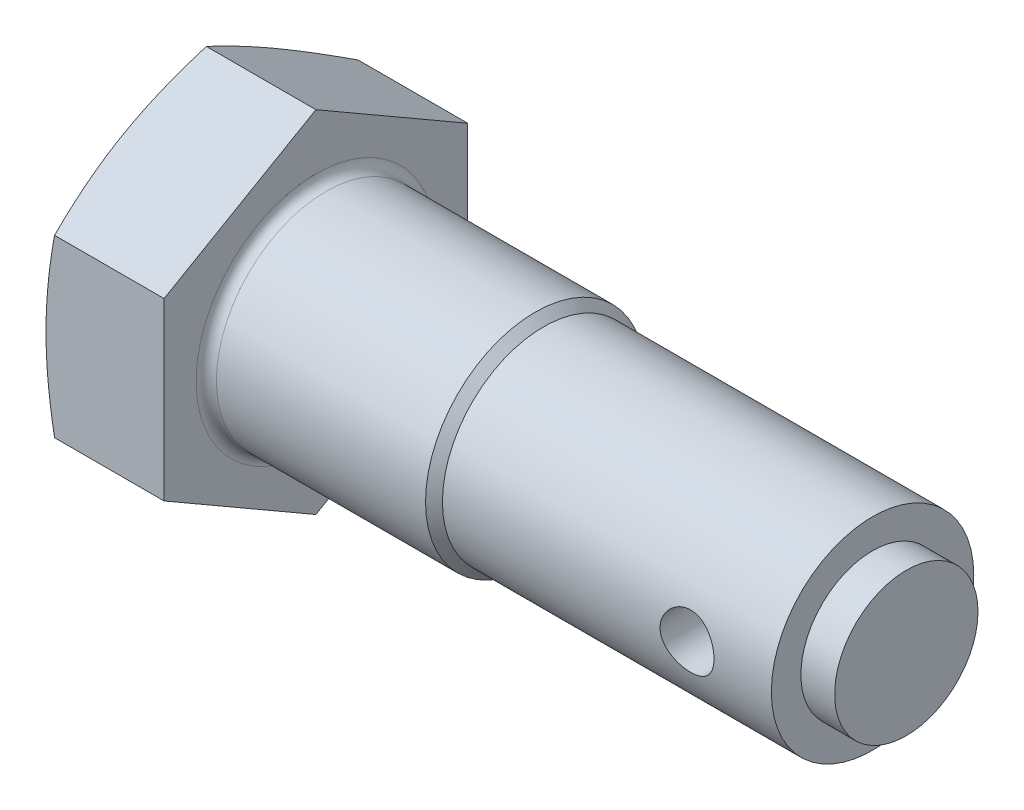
ISO-10303-21;
HEADER;
FILE_DESCRIPTION(('STEP AP214'),'2;1');
FILE_NAME('part.step','',(''),(''),'','','');
FILE_SCHEMA(('AUTOMOTIVE_DESIGN { 1 0 10303 214 1 1 1 1 }'));
ENDSEC;
DATA;
#1=APPLICATION_CONTEXT('core data for automotive mechanical design processes');
#2=APPLICATION_PROTOCOL_DEFINITION('international standard','automotive_design',2000,#1);
#3=PRODUCT_CONTEXT('',#1,'mechanical');
#4=PRODUCT('Part','Part','',(#3));
#5=PRODUCT_RELATED_PRODUCT_CATEGORY('part','',(#4));
#6=PRODUCT_DEFINITION_FORMATION('','',#4);
#7=PRODUCT_DEFINITION_CONTEXT('part definition',#1,'design');
#8=PRODUCT_DEFINITION('design','',#6,#7);
#9=PRODUCT_DEFINITION_SHAPE('','',#8);
#10=(LENGTH_UNIT() NAMED_UNIT(*) SI_UNIT(.MILLI.,.METRE.));
#11=(NAMED_UNIT(*) PLANE_ANGLE_UNIT() SI_UNIT($,.RADIAN.));
#12=(NAMED_UNIT(*) SI_UNIT($,.STERADIAN.) SOLID_ANGLE_UNIT());
#13=UNCERTAINTY_MEASURE_WITH_UNIT(LENGTH_MEASURE(1.E-05),#10,'distance_accuracy_value','');
#14=(GEOMETRIC_REPRESENTATION_CONTEXT(3) GLOBAL_UNCERTAINTY_ASSIGNED_CONTEXT((#13)) GLOBAL_UNIT_ASSIGNED_CONTEXT((#10,
#11,#12)) REPRESENTATION_CONTEXT('',''));
#15=CARTESIAN_POINT('',(0.,0.,0.));
#16=DIRECTION('',(0.,0.,1.));
#17=DIRECTION('',(1.,0.,0.));
#18=AXIS2_PLACEMENT_3D('',#15,#16,#17);
#19=CARTESIAN_POINT('',(7.,-5.19615242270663,9.));
#20=DIRECTION('',(0.,0.866025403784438,-0.5));
#21=DIRECTION('',(0.,0.5,0.866025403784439));
#22=AXIS2_PLACEMENT_3D('',#19,#20,#21);
#23=PLANE('',#22);
#24=CARTESIAN_POINT('',(0.506799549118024,-10.3924203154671,-0.000199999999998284));
#25=CARTESIAN_POINT('',(0.428447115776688,-10.1772266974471,0.372526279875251));
#26=CARTESIAN_POINT('',(0.357172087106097,-9.96132347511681,0.746481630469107));
#27=CARTESIAN_POINT('',(0.231774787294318,-9.52811323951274,1.49682376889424));
#28=CARTESIAN_POINT('',(0.177665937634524,-9.31080526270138,1.87321222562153));
#29=CARTESIAN_POINT('',(0.0901464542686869,-8.87719707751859,2.62424363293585));
#30=CARTESIAN_POINT('',(0.0565449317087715,-8.66090677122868,2.9988694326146));
#31=CARTESIAN_POINT('',(0.0114758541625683,-8.22782037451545,3.74899707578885));
#32=CARTESIAN_POINT('',(0.,-8.0110245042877,4.12449853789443));
#33=CARTESIAN_POINT('',(0.,-7.57743276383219,4.87550146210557));
#34=CARTESIAN_POINT('',(0.0114758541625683,-7.36063689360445,5.25100292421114));
#35=CARTESIAN_POINT('',(0.0565449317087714,-6.92755049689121,6.00113056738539));
#36=CARTESIAN_POINT('',(0.0901464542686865,-6.71126019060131,6.37575636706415));
#37=CARTESIAN_POINT('',(0.177665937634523,-6.27765200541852,7.12678777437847));
#38=CARTESIAN_POINT('',(0.231774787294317,-6.06034402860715,7.50317623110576));
#39=CARTESIAN_POINT('',(0.357172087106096,-5.62713379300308,8.25351836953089));
#40=CARTESIAN_POINT('',(0.428447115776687,-5.41123057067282,8.62747372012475));
#41=CARTESIAN_POINT('',(0.506799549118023,-5.19603695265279,9.0002));
#42=B_SPLINE_CURVE_WITH_KNOTS('',3,(#24,#25,#26,#27,#28,#29,#30,#31,#32,#33,#34,#35,#36,#37,#38,
#39,#40,#41),.UNSPECIFIED.,.F.,.F.,(4,2,2,2,2,2,2,2,4),(0.,1.3125188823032,2.62606145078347,
3.92718284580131,5.22781610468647,6.52844936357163,7.82957075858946,9.14311332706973,
10.4556322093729),.UNSPECIFIED.);
#43=CARTESIAN_POINT('',(0.506757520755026,-10.3923048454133,0.));
#44=VERTEX_POINT('',#43);
#45=CARTESIAN_POINT('',(0.,-7.79422863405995,4.5));
#46=VERTEX_POINT('',#45);
#47=EDGE_CURVE('E279',#44,#46,#42,.T.);
#48=ORIENTED_EDGE('',*,*,#47,.F.);
#49=DIRECTION('',(-1.,0.,0.));
#50=VECTOR('',#49,1.);
#51=CARTESIAN_POINT('',(7.,-10.3923048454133,0.));
#52=LINE('',#51,#50);
#53=CARTESIAN_POINT('',(7.,-10.3923048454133,0.));
#54=VERTEX_POINT('',#53);
#55=EDGE_CURVE('E149',#54,#44,#52,.T.);
#56=ORIENTED_EDGE('',*,*,#55,.F.);
#57=DIRECTION('',(0.,-0.5,-0.866025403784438));
#58=VECTOR('',#57,1.);
#59=CARTESIAN_POINT('',(7.,-5.19615242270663,9.));
#60=LINE('',#59,#58);
#61=CARTESIAN_POINT('',(7.,-5.19615242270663,9.));
#62=VERTEX_POINT('',#61);
#63=EDGE_CURVE('E291',#62,#54,#60,.T.);
#64=ORIENTED_EDGE('',*,*,#63,.F.);
#65=DIRECTION('',(-1.,0.,0.));
#66=VECTOR('',#65,1.);
#67=CARTESIAN_POINT('',(7.,-5.19615242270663,9.));
#68=LINE('',#67,#66);
#69=CARTESIAN_POINT('',(0.506757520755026,-5.19615242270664,9.));
#70=VERTEX_POINT('',#69);
#71=EDGE_CURVE('E136',#62,#70,#68,.T.);
#72=ORIENTED_EDGE('',*,*,#71,.T.);
#73=EDGE_CURVE('E130',#46,#70,#42,.T.);
#74=ORIENTED_EDGE('',*,*,#73,.F.);
#75=EDGE_LOOP('',(#48,#56,#64,#72,#74));
#76=FACE_BOUND('',#75,.T.);
#77=ADVANCED_FACE('F35',(#76),#23,.F.);
#78=CARTESIAN_POINT('',(7.,-10.3923048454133,0.));
#79=DIRECTION('',(0.,0.866025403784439,0.5));
#80=DIRECTION('',(0.,-0.5,0.866025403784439));
#81=AXIS2_PLACEMENT_3D('',#78,#79,#80);
#82=PLANE('',#81);
#83=CARTESIAN_POINT('',(0.506799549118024,-5.1960369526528,-9.0002));
#84=CARTESIAN_POINT('',(0.428447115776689,-5.41123057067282,-8.62747372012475));
#85=CARTESIAN_POINT('',(0.357172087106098,-5.62713379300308,-8.25351836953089));
#86=CARTESIAN_POINT('',(0.231774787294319,-6.06034402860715,-7.50317623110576));
#87=CARTESIAN_POINT('',(0.177665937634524,-6.27765200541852,-7.12678777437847));
#88=CARTESIAN_POINT('',(0.0901464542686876,-6.71126019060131,-6.37575636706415));
#89=CARTESIAN_POINT('',(0.0565449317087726,-6.92755049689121,-6.0011305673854));
#90=CARTESIAN_POINT('',(0.0114758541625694,-7.36063689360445,-5.25100292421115));
#91=CARTESIAN_POINT('',(0.,-7.5774327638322,-4.87550146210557));
#92=CARTESIAN_POINT('',(0.,-8.0110245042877,-4.12449853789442));
#93=CARTESIAN_POINT('',(0.0114758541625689,-8.22782037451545,-3.74899707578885));
#94=CARTESIAN_POINT('',(0.0565449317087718,-8.66090677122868,-2.9988694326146));
#95=CARTESIAN_POINT('',(0.0901464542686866,-8.87719707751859,-2.62424363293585));
#96=CARTESIAN_POINT('',(0.177665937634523,-9.31080526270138,-1.87321222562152));
#97=CARTESIAN_POINT('',(0.231774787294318,-9.52811323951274,-1.49682376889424));
#98=CARTESIAN_POINT('',(0.357172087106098,-9.96132347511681,-0.746481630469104));
#99=CARTESIAN_POINT('',(0.428447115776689,-10.1772266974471,-0.372526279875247));
#100=CARTESIAN_POINT('',(0.506799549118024,-10.3924203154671,0.000200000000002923));
#101=B_SPLINE_CURVE_WITH_KNOTS('',3,(#83,#84,#85,#86,#87,#88,#89,#90,#91,#92,#93,#94,#95,#96,
#97,#98,#99,#100),.UNSPECIFIED.,.F.,.F.,(4,2,2,2,2,2,2,2,4),(0.,1.3125188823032,
2.62606145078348,3.92718284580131,5.22781610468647,6.52844936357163,7.82957075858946,
9.14311332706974,10.4556322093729),.UNSPECIFIED.);
#102=CARTESIAN_POINT('',(0.506757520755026,-5.19615242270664,-9.));
#103=VERTEX_POINT('',#102);
#104=CARTESIAN_POINT('',(0.,-7.79422863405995,-4.5));
#105=VERTEX_POINT('',#104);
#106=EDGE_CURVE('E226',#103,#105,#101,.T.);
#107=ORIENTED_EDGE('',*,*,#106,.F.);
#108=DIRECTION('',(-1.,0.,0.));
#109=VECTOR('',#108,1.);
#110=CARTESIAN_POINT('',(7.,-5.19615242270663,-9.));
#111=LINE('',#110,#109);
#112=CARTESIAN_POINT('',(7.,-5.19615242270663,-9.));
#113=VERTEX_POINT('',#112);
#114=EDGE_CURVE('E146',#113,#103,#111,.T.);
#115=ORIENTED_EDGE('',*,*,#114,.F.);
#116=DIRECTION('',(0.,0.5,-0.866025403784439));
#117=VECTOR('',#116,1.);
#118=CARTESIAN_POINT('',(7.,-10.3923048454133,0.));
#119=LINE('',#118,#117);
#120=EDGE_CURVE('E286',#54,#113,#119,.T.);
#121=ORIENTED_EDGE('',*,*,#120,.F.);
#122=ORIENTED_EDGE('',*,*,#55,.T.);
#123=EDGE_CURVE('E222',#105,#44,#101,.T.);
#124=ORIENTED_EDGE('',*,*,#123,.F.);
#125=EDGE_LOOP('',(#107,#115,#121,#122,#124));
#126=FACE_BOUND('',#125,.T.);
#127=ADVANCED_FACE('F233',(#126),#82,.F.);
#128=CARTESIAN_POINT('',(7.,-5.19615242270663,-9.));
#129=DIRECTION('',(0.,0.,1.));
#130=DIRECTION('',(0.,-1.,0.));
#131=AXIS2_PLACEMENT_3D('',#128,#129,#130);
#132=PLANE('',#131);
#133=CARTESIAN_POINT('',(2.70791170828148,-13.7575861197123,-9.));
#134=CARTESIAN_POINT('',(2.58392170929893,-13.3503935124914,-9.));
#135=CARTESIAN_POINT('',(2.46137851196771,-12.9427521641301,-9.));
#136=CARTESIAN_POINT('',(2.21998608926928,-12.1263435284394,-9.));
#137=CARTESIAN_POINT('',(2.1011371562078,-11.7175761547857,-9.));
#138=CARTESIAN_POINT('',(1.86773592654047,-10.8979873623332,-9.));
#139=CARTESIAN_POINT('',(1.75319206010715,-10.4871635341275,-9.));
#140=CARTESIAN_POINT('',(1.52974196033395,-9.66398765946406,-9.));
#141=CARTESIAN_POINT('',(1.42083562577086,-9.25163564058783,-9.));
#142=CARTESIAN_POINT('',(1.21135618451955,-8.43022407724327,-9.));
#143=CARTESIAN_POINT('',(1.11069688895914,-8.02118662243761,-9.));
#144=CARTESIAN_POINT('',(0.917948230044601,-7.20107628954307,-9.));
#145=CARTESIAN_POINT('',(0.82585901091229,-6.79000337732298,-9.));
#146=CARTESIAN_POINT('',(0.652397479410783,-5.96573014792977,-9.));
#147=CARTESIAN_POINT('',(0.571021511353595,-5.55253060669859,-9.));
#148=CARTESIAN_POINT('',(0.421464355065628,-4.72373261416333,-9.));
#149=CARTESIAN_POINT('',(0.353282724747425,-4.30813424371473,-9.));
#150=CARTESIAN_POINT('',(0.239635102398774,-3.52133667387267,-9.));
#151=CARTESIAN_POINT('',(0.192479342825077,-3.15038384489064,-9.));
#152=CARTESIAN_POINT('',(0.112655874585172,-2.40690961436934,-9.));
#153=CARTESIAN_POINT('',(0.0799877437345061,-2.03438825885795,-9.));
#154=CARTESIAN_POINT('',(0.0307127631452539,-1.28853258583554,-9.));
#155=CARTESIAN_POINT('',(0.0140945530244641,-0.91519903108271,-9.));
#156=CARTESIAN_POINT('',(-0.00223920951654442,-0.168158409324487,-9.));
#157=CARTESIAN_POINT('',(-0.00195488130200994,0.205548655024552,-9.));
#158=CARTESIAN_POINT('',(0.0155452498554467,0.954455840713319,-9.));
#159=CARTESIAN_POINT('',(0.0328469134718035,1.32965392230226,-9.));
#160=CARTESIAN_POINT('',(0.0835854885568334,2.07894803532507,-9.));
#161=CARTESIAN_POINT('',(0.11702278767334,2.45304404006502,-9.));
#162=CARTESIAN_POINT('',(0.198468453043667,3.19994927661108,-9.));
#163=CARTESIAN_POINT('',(0.24648933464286,3.57275712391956,-9.));
#164=CARTESIAN_POINT('',(0.355154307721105,4.31650775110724,-9.));
#165=CARTESIAN_POINT('',(0.415798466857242,4.68745052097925,-9.));
#166=CARTESIAN_POINT('',(0.551226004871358,5.44699085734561,-9.));
#167=CARTESIAN_POINT('',(0.62658760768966,5.83548440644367,-9.));
#168=CARTESIAN_POINT('',(0.787010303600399,6.610476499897,-9.));
#169=CARTESIAN_POINT('',(0.872072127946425,6.9969748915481,-9.));
#170=CARTESIAN_POINT('',(1.05010913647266,7.76825208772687,-9.));
#171=CARTESIAN_POINT('',(1.14308661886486,8.15303035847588,-9.));
#172=CARTESIAN_POINT('',(1.33544249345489,8.92096599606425,-9.));
#173=CARTESIAN_POINT('',(1.43482073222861,9.30412340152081,-9.));
#174=CARTESIAN_POINT('',(1.63891256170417,10.0695366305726,-9.));
#175=CARTESIAN_POINT('',(1.74363284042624,10.451790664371,-9.));
#176=CARTESIAN_POINT('',(1.95733355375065,11.2151043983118,-9.));
#177=CARTESIAN_POINT('',(2.06631400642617,11.5961640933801,-9.));
#178=CARTESIAN_POINT('',(2.28775373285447,12.3571980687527,-9.));
#179=CARTESIAN_POINT('',(2.40021240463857,12.7371725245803,-9.));
#180=CARTESIAN_POINT('',(2.62802713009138,13.4962528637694,-9.));
#181=CARTESIAN_POINT('',(2.74338320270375,13.8753587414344,-9.));
#182=CARTESIAN_POINT('',(3.09047378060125,15.0032001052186,-9.));
#183=CARTESIAN_POINT('',(3.32570071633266,15.7508605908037,-9.));
#184=CARTESIAN_POINT('',(3.80282045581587,17.2440802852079,-9.));
#185=CARTESIAN_POINT('',(4.04471357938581,17.9896393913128,-9.));
#186=CARTESIAN_POINT('',(4.53246098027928,19.4763259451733,-9.));
#187=CARTESIAN_POINT('',(4.77829674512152,20.2174594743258,-8.99999999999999));
#188=CARTESIAN_POINT('',(5.14977743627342,21.3282121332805,-8.99999999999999));
#189=CARTESIAN_POINT('',(5.27405377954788,21.6982901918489,-8.99999999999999));
#190=CARTESIAN_POINT('',(5.52341062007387,22.4381743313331,-8.99999999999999));
#191=CARTESIAN_POINT('',(5.64849111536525,22.8079804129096,-8.99999999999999));
#192=CARTESIAN_POINT('',(5.77391997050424,23.1776683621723,-8.99999999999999));
#193=B_SPLINE_CURVE_WITH_KNOTS('',3,(#133,#134,#135,#136,#137,#138,#139,#140,#141,#142,#143,
#144,#145,#146,#147,#148,#149,#150,#151,#152,#153,#154,#155,#156,#157,#158,#159,#160,#161,#162,
#163,#164,#165,#166,#167,#168,#169,#170,#171,#172,#173,#174,#175,#176,#177,#178,#179,#180,#181,
#182,#183,#184,#185,#186,#187,#188,#189,#190,#191,#192),.UNSPECIFIED.,.F.,.F.,(4,2,2,2,2,2,2,2,
2,2,2,2,2,2,2,2,2,2,2,2,2,2,2,2,2,2,2,2,2,4),(0.,1.27696403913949,2.55402886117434,
3.8334763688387,5.11290089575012,6.37655077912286,7.64022192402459,8.90346074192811,
10.1666572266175,11.2882250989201,12.4097602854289,13.5305010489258,14.6512338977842,
15.7776505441,16.9040942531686,18.0315073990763,19.1589265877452,20.3459813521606,
21.5331256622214,22.7206158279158,23.9080775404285,25.0970642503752,26.2860560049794,
27.4748431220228,28.6636380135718,31.0149593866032,33.3663937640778,35.708906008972,
36.8800677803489,38.0512266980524),.UNSPECIFIED.);
#194=CARTESIAN_POINT('',(0.506757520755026,5.19615242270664,-9.));
#195=VERTEX_POINT('',#194);
#196=CARTESIAN_POINT('',(0.,0.,-9.));
#197=VERTEX_POINT('',#196);
#198=EDGE_CURVE('E307',#195,#197,#193,.F.);
#199=ORIENTED_EDGE('',*,*,#198,.F.);
#200=DIRECTION('',(-1.,0.,0.));
#201=VECTOR('',#200,1.);
#202=CARTESIAN_POINT('',(7.,5.19615242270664,-9.));
#203=LINE('',#202,#201);
#204=CARTESIAN_POINT('',(7.,5.19615242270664,-9.));
#205=VERTEX_POINT('',#204);
#206=EDGE_CURVE('E138',#205,#195,#203,.T.);
#207=ORIENTED_EDGE('',*,*,#206,.F.);
#208=DIRECTION('',(0.,1.,0.));
#209=VECTOR('',#208,1.);
#210=CARTESIAN_POINT('',(7.,-5.19615242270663,-9.));
#211=LINE('',#210,#209);
#212=EDGE_CURVE('E290',#113,#205,#211,.T.);
#213=ORIENTED_EDGE('',*,*,#212,.F.);
#214=ORIENTED_EDGE('',*,*,#114,.T.);
#215=EDGE_CURVE('E227',#197,#103,#193,.F.);
#216=ORIENTED_EDGE('',*,*,#215,.F.);
#217=EDGE_LOOP('',(#199,#207,#213,#214,#216));
#218=FACE_BOUND('',#217,.T.);
#219=ADVANCED_FACE('F236',(#218),#132,.F.);
#220=CARTESIAN_POINT('',(7.,5.19615242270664,-9.));
#221=DIRECTION('',(0.,-0.866025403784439,0.5));
#222=DIRECTION('',(0.,-0.5,-0.866025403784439));
#223=AXIS2_PLACEMENT_3D('',#220,#221,#222);
#224=PLANE('',#223);
#225=CARTESIAN_POINT('',(0.506799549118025,10.3924203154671,0.000199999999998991));
#226=CARTESIAN_POINT('',(0.42844711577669,10.1772266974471,-0.372526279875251));
#227=CARTESIAN_POINT('',(0.357172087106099,9.96132347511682,-0.746481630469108));
#228=CARTESIAN_POINT('',(0.23177478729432,9.52811323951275,-1.49682376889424));
#229=CARTESIAN_POINT('',(0.177665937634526,9.31080526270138,-1.87321222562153));
#230=CARTESIAN_POINT('',(0.0901464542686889,8.87719707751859,-2.62424363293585));
#231=CARTESIAN_POINT('',(0.0565449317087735,8.66090677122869,-2.9988694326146));
#232=CARTESIAN_POINT('',(0.0114758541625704,8.22782037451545,-3.74899707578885));
#233=CARTESIAN_POINT('',(0.,8.0110245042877,-4.12449853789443));
#234=CARTESIAN_POINT('',(0.,7.5774327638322,-4.87550146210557));
#235=CARTESIAN_POINT('',(0.0114758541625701,7.36063689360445,-5.25100292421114));
#236=CARTESIAN_POINT('',(0.0565449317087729,6.92755049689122,-6.00113056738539));
#237=CARTESIAN_POINT('',(0.0901464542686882,6.71126019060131,-6.37575636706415));
#238=CARTESIAN_POINT('',(0.177665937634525,6.27765200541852,-7.12678777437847));
#239=CARTESIAN_POINT('',(0.231774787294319,6.06034402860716,-7.50317623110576));
#240=CARTESIAN_POINT('',(0.357172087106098,5.62713379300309,-8.25351836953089));
#241=CARTESIAN_POINT('',(0.428447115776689,5.41123057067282,-8.62747372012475));
#242=CARTESIAN_POINT('',(0.506799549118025,5.1960369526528,-9.0002));
#243=B_SPLINE_CURVE_WITH_KNOTS('',3,(#225,#226,#227,#228,#229,#230,#231,#232,#233,#234,#235,
#236,#237,#238,#239,#240,#241,#242),.UNSPECIFIED.,.F.,.F.,(4,2,2,2,2,2,2,2,4),(0.,
1.3125188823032,2.62606145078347,3.92718284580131,5.22781610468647,6.52844936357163,
7.82957075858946,9.14311332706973,10.4556322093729),.UNSPECIFIED.);
#244=CARTESIAN_POINT('',(0.506757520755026,10.3923048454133,0.));
#245=VERTEX_POINT('',#244);
#246=CARTESIAN_POINT('',(0.,7.79422863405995,-4.5));
#247=VERTEX_POINT('',#246);
#248=EDGE_CURVE('E56',#245,#247,#243,.T.);
#249=ORIENTED_EDGE('',*,*,#248,.F.);
#250=DIRECTION('',(-1.,0.,0.));
#251=VECTOR('',#250,1.);
#252=CARTESIAN_POINT('',(7.,10.3923048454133,0.));
#253=LINE('',#252,#251);
#254=CARTESIAN_POINT('',(7.,10.3923048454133,0.));
#255=VERTEX_POINT('',#254);
#256=EDGE_CURVE('E135',#255,#245,#253,.T.);
#257=ORIENTED_EDGE('',*,*,#256,.F.);
#258=DIRECTION('',(0.,0.5,0.866025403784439));
#259=VECTOR('',#258,1.);
#260=CARTESIAN_POINT('',(7.,5.19615242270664,-9.));
#261=LINE('',#260,#259);
#262=EDGE_CURVE('E299',#205,#255,#261,.T.);
#263=ORIENTED_EDGE('',*,*,#262,.F.);
#264=ORIENTED_EDGE('',*,*,#206,.T.);
#265=EDGE_CURVE('E305',#247,#195,#243,.T.);
#266=ORIENTED_EDGE('',*,*,#265,.F.);
#267=EDGE_LOOP('',(#249,#257,#263,#264,#266));
#268=FACE_BOUND('',#267,.T.);
#269=ADVANCED_FACE('F240',(#268),#224,.F.);
#270=CARTESIAN_POINT('',(7.,10.3923048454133,0.));
#271=DIRECTION('',(0.,-0.866025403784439,-0.5));
#272=DIRECTION('',(0.,0.5,-0.866025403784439));
#273=AXIS2_PLACEMENT_3D('',#270,#271,#272);
#274=PLANE('',#273);
#275=CARTESIAN_POINT('',(0.506799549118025,5.1960369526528,9.0002));
#276=CARTESIAN_POINT('',(0.42844711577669,5.41123057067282,8.62747372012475));
#277=CARTESIAN_POINT('',(0.357172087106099,5.62713379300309,8.25351836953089));
#278=CARTESIAN_POINT('',(0.231774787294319,6.06034402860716,7.50317623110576));
#279=CARTESIAN_POINT('',(0.177665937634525,6.27765200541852,7.12678777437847));
#280=CARTESIAN_POINT('',(0.090146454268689,6.71126019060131,6.37575636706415));
#281=CARTESIAN_POINT('',(0.0565449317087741,6.92755049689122,6.0011305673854));
#282=CARTESIAN_POINT('',(0.011475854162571,7.36063689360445,5.25100292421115));
#283=CARTESIAN_POINT('',(0.,7.5774327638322,4.87550146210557));
#284=CARTESIAN_POINT('',(0.,8.0110245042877,4.12449853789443));
#285=CARTESIAN_POINT('',(0.0114758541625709,8.22782037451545,3.74899707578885));
#286=CARTESIAN_POINT('',(0.0565449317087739,8.66090677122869,2.9988694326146));
#287=CARTESIAN_POINT('',(0.0901464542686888,8.87719707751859,2.62424363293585));
#288=CARTESIAN_POINT('',(0.177665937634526,9.31080526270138,1.87321222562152));
#289=CARTESIAN_POINT('',(0.23177478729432,9.52811323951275,1.49682376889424));
#290=CARTESIAN_POINT('',(0.3571720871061,9.96132347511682,0.746481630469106));
#291=CARTESIAN_POINT('',(0.428447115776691,10.1772266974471,0.37252627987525));
#292=CARTESIAN_POINT('',(0.506799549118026,10.3924203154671,-0.000200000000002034));
#293=B_SPLINE_CURVE_WITH_KNOTS('',3,(#275,#276,#277,#278,#279,#280,#281,#282,#283,#284,#285,
#286,#287,#288,#289,#290,#291,#292),.UNSPECIFIED.,.F.,.F.,(4,2,2,2,2,2,2,2,4),(0.,
1.3125188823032,2.62606145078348,3.92718284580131,5.22781610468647,6.52844936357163,
7.82957075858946,9.14311332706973,10.4556322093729),.UNSPECIFIED.);
#294=CARTESIAN_POINT('',(0.506757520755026,5.19615242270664,9.));
#295=VERTEX_POINT('',#294);
#296=CARTESIAN_POINT('',(0.,7.79422863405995,4.5));
#297=VERTEX_POINT('',#296);
#298=EDGE_CURVE('E64',#295,#297,#293,.T.);
#299=ORIENTED_EDGE('',*,*,#298,.F.);
#300=DIRECTION('',(-1.,0.,0.));
#301=VECTOR('',#300,1.);
#302=CARTESIAN_POINT('',(7.,5.19615242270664,9.));
#303=LINE('',#302,#301);
#304=CARTESIAN_POINT('',(7.,5.19615242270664,9.));
#305=VERTEX_POINT('',#304);
#306=EDGE_CURVE('E126',#305,#295,#303,.T.);
#307=ORIENTED_EDGE('',*,*,#306,.F.);
#308=DIRECTION('',(0.,-0.5,0.866025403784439));
#309=VECTOR('',#308,1.);
#310=CARTESIAN_POINT('',(7.,10.3923048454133,0.));
#311=LINE('',#310,#309);
#312=EDGE_CURVE('E301',#255,#305,#311,.T.);
#313=ORIENTED_EDGE('',*,*,#312,.F.);
#314=ORIENTED_EDGE('',*,*,#256,.T.);
#315=EDGE_CURVE('E129',#297,#245,#293,.T.);
#316=ORIENTED_EDGE('',*,*,#315,.F.);
#317=EDGE_LOOP('',(#299,#307,#313,#314,#316));
#318=FACE_BOUND('',#317,.T.);
#319=ADVANCED_FACE('F124',(#318),#274,.F.);
#320=CARTESIAN_POINT('',(7.,5.19615242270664,9.));
#321=DIRECTION('',(0.,0.,-1.));
#322=DIRECTION('',(0.,1.,0.));
#323=AXIS2_PLACEMENT_3D('',#320,#321,#322);
#324=PLANE('',#323);
#325=CARTESIAN_POINT('',(2.70791122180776,-13.7575845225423,9.));
#326=CARTESIAN_POINT('',(2.5839212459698,-13.3503919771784,9.));
#327=CARTESIAN_POINT('',(2.46137807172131,-12.9427506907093,9.));
#328=CARTESIAN_POINT('',(2.21998569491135,-12.126342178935,9.));
#329=CARTESIAN_POINT('',(2.10113678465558,-11.7175748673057,9.));
#330=CARTESIAN_POINT('',(1.8677356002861,-10.8979861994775,9.));
#331=CARTESIAN_POINT('',(1.75319175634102,-10.487162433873,9.));
#332=CARTESIAN_POINT('',(1.52974170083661,-9.66398668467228,9.));
#333=CARTESIAN_POINT('',(1.42083538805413,-9.25163472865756,9.));
#334=CARTESIAN_POINT('',(1.21135598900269,-8.43022329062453,9.));
#335=CARTESIAN_POINT('',(1.11069671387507,-8.02118589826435,9.));
#336=CARTESIAN_POINT('',(0.917948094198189,-7.20107569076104,9.));
#337=CARTESIAN_POINT('',(0.825858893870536,-6.79000284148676,9.));
#338=CARTESIAN_POINT('',(0.652397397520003,-5.96572973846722,9.));
#339=CARTESIAN_POINT('',(0.571021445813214,-5.55253026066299,9.));
#340=CARTESIAN_POINT('',(0.421464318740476,-4.72373239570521,9.));
#341=CARTESIAN_POINT('',(0.353282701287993,-4.30813408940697,9.));
#342=CARTESIAN_POINT('',(0.239635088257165,-3.52133656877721,9.));
#343=CARTESIAN_POINT('',(0.192479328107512,-3.15038372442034,9.));
#344=CARTESIAN_POINT('',(0.112655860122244,-2.40690946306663,9.));
#345=CARTESIAN_POINT('',(0.0799877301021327,-2.03438809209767,9.));
#346=CARTESIAN_POINT('',(0.030712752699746,-1.28853238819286,9.));
#347=CARTESIAN_POINT('',(0.0140945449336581,-0.91519881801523,9.));
#348=CARTESIAN_POINT('',(-0.00223921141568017,-0.168158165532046,9.));
#349=CARTESIAN_POINT('',(-0.00195487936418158,0.205548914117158,9.));
#350=CARTESIAN_POINT('',(0.0155452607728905,0.954456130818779,9.));
#351=CARTESIAN_POINT('',(0.0328469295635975,1.32965422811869,9.));
#352=CARTESIAN_POINT('',(0.0835855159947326,2.07894837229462,9.));
#353=CARTESIAN_POINT('',(0.117022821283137,2.45304439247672,9.));
#354=CARTESIAN_POINT('',(0.198468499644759,3.19994965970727,9.));
#355=CARTESIAN_POINT('',(0.246489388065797,3.57275752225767,9.));
#356=CARTESIAN_POINT('',(0.355154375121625,4.31650817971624,9.));
#357=CARTESIAN_POINT('',(0.415798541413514,4.68745096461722,9.));
#358=CARTESIAN_POINT('',(0.551226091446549,5.44699131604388,9.));
#359=CARTESIAN_POINT('',(0.626587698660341,5.83548486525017,9.));
#360=CARTESIAN_POINT('',(0.787010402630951,6.61047695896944,9.));
#361=CARTESIAN_POINT('',(0.872072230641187,6.99697535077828,9.));
#362=CARTESIAN_POINT('',(1.05010924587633,7.7682525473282,9.));
#363=CARTESIAN_POINT('',(1.14308673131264,8.15303081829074,9.));
#364=CARTESIAN_POINT('',(1.33544261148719,8.92096645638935,9.));
#365=CARTESIAN_POINT('',(1.43482085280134,9.30412386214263,9.));
#366=CARTESIAN_POINT('',(1.63891268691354,10.0695370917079,9.));
#367=CARTESIAN_POINT('',(1.74363296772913,10.4517911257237,9.));
#368=CARTESIAN_POINT('',(1.95733368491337,11.2151048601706,9.));
#369=CARTESIAN_POINT('',(2.06631413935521,11.5961645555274,9.));
#370=CARTESIAN_POINT('',(2.28775386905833,12.3571985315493,9.));
#371=CARTESIAN_POINT('',(2.40021254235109,12.7371729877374,9.));
#372=CARTESIAN_POINT('',(2.62802727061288,13.4962533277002,9.));
#373=CARTESIAN_POINT('',(2.74338334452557,13.8753592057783,9.));
#374=CARTESIAN_POINT('',(3.09047392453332,15.0032005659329,9.));
#375=CARTESIAN_POINT('',(3.32570086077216,15.7508610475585,9.));
#376=CARTESIAN_POINT('',(3.80282060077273,17.2440807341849,9.));
#377=CARTESIAN_POINT('',(4.04471372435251,17.9896398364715,9.));
#378=CARTESIAN_POINT('',(4.53246112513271,19.4763263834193,9.));
#379=CARTESIAN_POINT('',(4.77829688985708,20.2174599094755,9.));
#380=CARTESIAN_POINT('',(5.14977758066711,21.3282125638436,9.));
#381=CARTESIAN_POINT('',(5.27405392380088,21.698290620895,9.));
#382=CARTESIAN_POINT('',(5.52341076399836,22.4381747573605,9.));
#383=CARTESIAN_POINT('',(5.64849125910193,22.8079808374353,9.));
#384=CARTESIAN_POINT('',(5.77392011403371,23.1776687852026,9.));
#385=B_SPLINE_CURVE_WITH_KNOTS('',3,(#325,#326,#327,#328,#329,#330,#331,#332,#333,#334,#335,
#336,#337,#338,#339,#340,#341,#342,#343,#344,#345,#346,#347,#348,#349,#350,#351,#352,#353,#354,
#355,#356,#357,#358,#359,#360,#361,#362,#363,#364,#365,#366,#367,#368,#369,#370,#371,#372,#373,
#374,#375,#376,#377,#378,#379,#380,#381,#382,#383,#384),.UNSPECIFIED.,.F.,.F.,(4,2,2,2,2,2,2,2,
2,2,2,2,2,2,2,2,2,2,2,2,2,2,2,2,2,2,2,2,2,4),(0.,1.27696384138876,2.55402846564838,
3.83347577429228,5.1129001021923,6.37654978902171,7.64022073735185,8.90345935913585,
10.1666556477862,11.2882235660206,12.4097587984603,13.5304996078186,14.6512325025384,
15.777649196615,16.9040929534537,18.0315061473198,19.1589253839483,20.3459801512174,
21.5331244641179,22.7206146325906,23.9080763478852,25.0970630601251,26.2860548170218,
27.4748419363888,28.6636368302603,31.0149581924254,33.3663925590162,35.7089047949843,
36.8800665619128,38.0512254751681),.UNSPECIFIED.);
#386=CARTESIAN_POINT('',(0.,0.,9.));
#387=VERTEX_POINT('',#386);
#388=EDGE_CURVE('E119',#70,#387,#385,.T.);
#389=ORIENTED_EDGE('',*,*,#388,.F.);
#390=ORIENTED_EDGE('',*,*,#71,.F.);
#391=DIRECTION('',(0.,-1.,0.));
#392=VECTOR('',#391,1.);
#393=CARTESIAN_POINT('',(7.,5.19615242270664,9.));
#394=LINE('',#393,#392);
#395=EDGE_CURVE('E134',#305,#62,#394,.T.);
#396=ORIENTED_EDGE('',*,*,#395,.F.);
#397=ORIENTED_EDGE('',*,*,#306,.T.);
#398=EDGE_CURVE('E111',#387,#295,#385,.T.);
#399=ORIENTED_EDGE('',*,*,#398,.F.);
#400=EDGE_LOOP('',(#389,#390,#396,#397,#399));
#401=FACE_BOUND('',#400,.T.);
#402=ADVANCED_FACE('F132',(#401),#324,.F.);
#403=CARTESIAN_POINT('',(93.9705627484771,0.,0.));
#404=DIRECTION('',(-1.,0.,0.));
#405=DIRECTION('',(0.,0.,1.));
#406=AXIS2_PLACEMENT_3D('',#403,#404,#405);
#407=CYLINDRICAL_SURFACE('',#406,6.);
#408=CARTESIAN_POINT('',(36.6,0.,6.));
#409=CARTESIAN_POINT('',(36.5999979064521,-0.0882036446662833,5.9999986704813));
#410=CARTESIAN_POINT('',(36.5926819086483,-0.176429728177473,5.99803588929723));
#411=CARTESIAN_POINT('',(36.5636630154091,-0.35034036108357,5.99039658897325));
#412=CARTESIAN_POINT('',(36.5419531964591,-0.436023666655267,5.98471828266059));
#413=CARTESIAN_POINT('',(36.4849026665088,-0.60231327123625,5.97027466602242));
#414=CARTESIAN_POINT('',(36.4495795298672,-0.68292596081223,5.96151333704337));
#415=CARTESIAN_POINT('',(36.3663702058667,-0.837082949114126,5.94182959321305));
#416=CARTESIAN_POINT('',(36.3184831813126,-0.910626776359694,5.93090703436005));
#417=CARTESIAN_POINT('',(36.2103331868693,-1.05026360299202,5.90779691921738));
#418=CARTESIAN_POINT('',(36.1498330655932,-1.11616935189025,5.8955877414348));
#419=CARTESIAN_POINT('',(36.0186812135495,-1.23702970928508,5.87141927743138));
#420=CARTESIAN_POINT('',(35.9480281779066,-1.29198290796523,5.85946002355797));
#421=CARTESIAN_POINT('',(35.797081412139,-1.3902912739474,5.83692429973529));
#422=CARTESIAN_POINT('',(35.7166429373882,-1.43343102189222,5.82637510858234));
#423=CARTESIAN_POINT('',(35.5493279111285,-1.50550038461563,5.80817181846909));
#424=CARTESIAN_POINT('',(35.4624525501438,-1.53443261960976,5.8005171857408));
#425=CARTESIAN_POINT('',(35.2868035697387,-1.5766153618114,5.78919292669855));
#426=CARTESIAN_POINT('',(35.1981171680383,-1.59020536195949,5.78543718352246));
#427=CARTESIAN_POINT('',(35.0196498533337,-1.60237627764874,5.78207864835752));
#428=CARTESIAN_POINT('',(34.9298691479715,-1.60095999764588,5.78247508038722));
#429=CARTESIAN_POINT('',(34.7544116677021,-1.58342808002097,5.78729903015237));
#430=CARTESIAN_POINT('',(34.6686902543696,-1.56772324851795,5.79161388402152));
#431=CARTESIAN_POINT('',(34.5011453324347,-1.52271798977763,5.80360810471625));
#432=CARTESIAN_POINT('',(34.4193221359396,-1.493416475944,5.81128774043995));
#433=CARTESIAN_POINT('',(34.2608254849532,-1.421714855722,5.82924529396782));
#434=CARTESIAN_POINT('',(34.184220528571,-1.37917072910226,5.83955154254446));
#435=CARTESIAN_POINT('',(34.0390926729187,-1.28229203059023,5.86158583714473));
#436=CARTESIAN_POINT('',(33.9705713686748,-1.22795513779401,5.8733141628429));
#437=CARTESIAN_POINT('',(33.8412088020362,-1.10693285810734,5.89734008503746));
#438=CARTESIAN_POINT('',(33.780690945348,-1.03990250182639,5.90964377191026));
#439=CARTESIAN_POINT('',(33.6716889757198,-0.896494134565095,5.93309105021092));
#440=CARTESIAN_POINT('',(33.6232053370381,-0.820115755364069,5.94423459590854));
#441=CARTESIAN_POINT('',(33.5395056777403,-0.659678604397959,5.96417456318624));
#442=CARTESIAN_POINT('',(33.5043481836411,-0.575587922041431,5.97296058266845));
#443=CARTESIAN_POINT('',(33.4487622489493,-0.402401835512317,5.98712035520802));
#444=CARTESIAN_POINT('',(33.4283305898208,-0.313307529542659,5.99249485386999));
#445=CARTESIAN_POINT('',(33.4032840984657,-0.135403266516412,5.99911326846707));
#446=CARTESIAN_POINT('',(33.3982295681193,-0.0466593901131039,6.00047197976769));
#447=CARTESIAN_POINT('',(33.4028665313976,0.130408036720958,5.99923577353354));
#448=CARTESIAN_POINT('',(33.4125565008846,0.218731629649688,5.99664126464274));
#449=CARTESIAN_POINT('',(33.446046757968,0.390881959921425,5.98786428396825));
#450=CARTESIAN_POINT('',(33.4696017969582,0.474759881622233,5.98174421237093));
#451=CARTESIAN_POINT('',(33.5298687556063,0.637365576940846,5.96661035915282));
#452=CARTESIAN_POINT('',(33.5665821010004,0.716092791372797,5.9575962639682));
#453=CARTESIAN_POINT('',(33.6529391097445,0.867870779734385,5.93740528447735));
#454=CARTESIAN_POINT('',(33.7028219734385,0.940780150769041,5.92618949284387));
#455=CARTESIAN_POINT('',(33.8138013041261,1.07734770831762,5.9028916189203));
#456=CARTESIAN_POINT('',(33.8748999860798,1.14100406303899,5.89080936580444));
#457=CARTESIAN_POINT('',(34.0086284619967,1.25911139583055,5.86671796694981));
#458=CARTESIAN_POINT('',(34.0815348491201,1.31325215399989,5.85472049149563));
#459=CARTESIAN_POINT('',(34.2356517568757,1.40853752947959,5.83253157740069));
#460=CARTESIAN_POINT('',(34.316861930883,1.44968268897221,5.82234006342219));
#461=CARTESIAN_POINT('',(34.4848762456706,1.51749929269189,5.80503414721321));
#462=CARTESIAN_POINT('',(34.5716446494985,1.54425449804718,5.79790198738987));
#463=CARTESIAN_POINT('',(34.7486714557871,1.58272964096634,5.78751860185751));
#464=CARTESIAN_POINT('',(34.8389289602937,1.5944534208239,5.78426638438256));
#465=CARTESIAN_POINT('',(35.017195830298,1.60231191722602,5.78209395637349));
#466=CARTESIAN_POINT('',(35.1051818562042,1.59894524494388,5.78303518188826));
#467=CARTESIAN_POINT('',(35.2792828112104,1.5778750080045,5.78881916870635));
#468=CARTESIAN_POINT('',(35.3653977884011,1.56017181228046,5.79366182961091));
#469=CARTESIAN_POINT('',(35.5326846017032,1.51122012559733,5.80662056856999));
#470=CARTESIAN_POINT('',(35.6138894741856,1.48007728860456,5.81471108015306));
#471=CARTESIAN_POINT('',(35.7699830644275,1.40521243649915,5.83325454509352));
#472=CARTESIAN_POINT('',(35.8448707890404,1.36148844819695,5.84370786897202));
#473=CARTESIAN_POINT('',(35.9885842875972,1.26119127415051,5.86618337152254));
#474=CARTESIAN_POINT('',(36.057166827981,1.20427783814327,5.87824266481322));
#475=CARTESIAN_POINT('',(36.1839699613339,1.0798644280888,5.90236403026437));
#476=CARTESIAN_POINT('',(36.2421880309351,1.01236188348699,5.91442610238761));
#477=CARTESIAN_POINT('',(36.3478337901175,0.866943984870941,5.93750249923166));
#478=CARTESIAN_POINT('',(36.3950040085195,0.78883676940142,5.94848889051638));
#479=CARTESIAN_POINT('',(36.4754699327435,0.625510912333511,5.9678704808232));
#480=CARTESIAN_POINT('',(36.5087745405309,0.540296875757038,5.97626734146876));
#481=CARTESIAN_POINT('',(36.5562202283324,0.379499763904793,5.98843802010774));
#482=CARTESIAN_POINT('',(36.572599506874,0.30460961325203,5.99274216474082));
#483=CARTESIAN_POINT('',(36.5944897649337,0.153151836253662,5.99852359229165));
#484=CARTESIAN_POINT('',(36.60000181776,0.0765843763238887,6.00000115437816));
#485=CARTESIAN_POINT('',(36.6,0.,6.));
#486=B_SPLINE_CURVE_WITH_KNOTS('',3,(#408,#409,#410,#411,#412,#413,#414,#415,#416,#417,#418,
#419,#420,#421,#422,#423,#424,#425,#426,#427,#428,#429,#430,#431,#432,#433,#434,#435,#436,#437,
#438,#439,#440,#441,#442,#443,#444,#445,#446,#447,#448,#449,#450,#451,#452,#453,#454,#455,#456,
#457,#458,#459,#460,#461,#462,#463,#464,#465,#466,#467,#468,#469,#470,#471,#472,#473,#474,#475,
#476,#477,#478,#479,#480,#481,#482,#483,#484,#485),.UNSPECIFIED.,.T.,.F.,(4,2,2,2,2,2,2,2,2,2,2,
2,2,2,2,2,2,2,2,2,2,2,2,2,2,2,2,2,2,2,2,2,2,2,2,2,2,2,4),(0.,0.264330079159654,0.52878739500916,
0.792904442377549,1.0570390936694,1.32667918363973,1.59635395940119,1.87066066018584,
2.1449167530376,2.41297726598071,2.68098768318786,2.94152801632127,3.20208917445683,
3.4655893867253,3.72914150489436,4.00129007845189,4.27344937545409,4.54679047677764,
4.82007181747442,5.08546174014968,5.35082423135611,5.61162828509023,5.87246060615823,
6.13840228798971,6.4043965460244,6.67789197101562,6.95137598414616,7.2232503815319,
7.4950552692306,7.75794673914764,8.02083144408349,8.28168612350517,8.54258173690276,
8.81115471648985,9.07979299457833,9.35417801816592,9.62838660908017,9.85791855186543,
10.0874278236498),.UNSPECIFIED.);
#487=CARTESIAN_POINT('',(36.6,0.,6.));
#488=VERTEX_POINT('',#487);
#489=EDGE_CURVE('E39',#488,#488,#486,.T.);
#490=ORIENTED_EDGE('',*,*,#489,.T.);
#491=EDGE_LOOP('',(#490));
#492=FACE_BOUND('',#491,.T.);
#493=CARTESIAN_POINT('',(36.6,0.,-6.));
#494=CARTESIAN_POINT('',(36.5999979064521,0.0882036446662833,-5.9999986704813));
#495=CARTESIAN_POINT('',(36.5926819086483,0.176429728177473,-5.99803588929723));
#496=CARTESIAN_POINT('',(36.5636630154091,0.35034036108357,-5.99039658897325));
#497=CARTESIAN_POINT('',(36.5419531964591,0.436023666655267,-5.98471828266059));
#498=CARTESIAN_POINT('',(36.4849026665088,0.60231327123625,-5.97027466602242));
#499=CARTESIAN_POINT('',(36.4495795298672,0.68292596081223,-5.96151333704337));
#500=CARTESIAN_POINT('',(36.3663702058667,0.837082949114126,-5.94182959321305));
#501=CARTESIAN_POINT('',(36.3184831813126,0.910626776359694,-5.93090703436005));
#502=CARTESIAN_POINT('',(36.2103331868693,1.05026360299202,-5.90779691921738));
#503=CARTESIAN_POINT('',(36.1498330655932,1.11616935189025,-5.8955877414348));
#504=CARTESIAN_POINT('',(36.0186812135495,1.23702970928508,-5.87141927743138));
#505=CARTESIAN_POINT('',(35.9480281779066,1.29198290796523,-5.85946002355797));
#506=CARTESIAN_POINT('',(35.797081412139,1.3902912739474,-5.83692429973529));
#507=CARTESIAN_POINT('',(35.7166429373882,1.43343102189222,-5.82637510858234));
#508=CARTESIAN_POINT('',(35.5493279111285,1.50550038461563,-5.80817181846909));
#509=CARTESIAN_POINT('',(35.4624525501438,1.53443261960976,-5.8005171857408));
#510=CARTESIAN_POINT('',(35.2868035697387,1.5766153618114,-5.78919292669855));
#511=CARTESIAN_POINT('',(35.1981171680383,1.59020536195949,-5.78543718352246));
#512=CARTESIAN_POINT('',(35.0196498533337,1.60237627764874,-5.78207864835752));
#513=CARTESIAN_POINT('',(34.9298691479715,1.60095999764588,-5.78247508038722));
#514=CARTESIAN_POINT('',(34.7544116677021,1.58342808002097,-5.78729903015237));
#515=CARTESIAN_POINT('',(34.6686902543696,1.56772324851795,-5.79161388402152));
#516=CARTESIAN_POINT('',(34.5011453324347,1.52271798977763,-5.80360810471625));
#517=CARTESIAN_POINT('',(34.4193221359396,1.493416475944,-5.81128774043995));
#518=CARTESIAN_POINT('',(34.2608254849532,1.421714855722,-5.82924529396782));
#519=CARTESIAN_POINT('',(34.184220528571,1.37917072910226,-5.83955154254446));
#520=CARTESIAN_POINT('',(34.0390926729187,1.28229203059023,-5.86158583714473));
#521=CARTESIAN_POINT('',(33.9705713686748,1.22795513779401,-5.8733141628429));
#522=CARTESIAN_POINT('',(33.8412088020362,1.10693285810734,-5.89734008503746));
#523=CARTESIAN_POINT('',(33.780690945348,1.03990250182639,-5.90964377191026));
#524=CARTESIAN_POINT('',(33.6716889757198,0.896494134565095,-5.93309105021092));
#525=CARTESIAN_POINT('',(33.6232053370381,0.820115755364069,-5.94423459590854));
#526=CARTESIAN_POINT('',(33.5395056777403,0.659678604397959,-5.96417456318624));
#527=CARTESIAN_POINT('',(33.5043481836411,0.575587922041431,-5.97296058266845));
#528=CARTESIAN_POINT('',(33.4487622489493,0.402401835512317,-5.98712035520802));
#529=CARTESIAN_POINT('',(33.4283305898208,0.313307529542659,-5.99249485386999));
#530=CARTESIAN_POINT('',(33.4032840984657,0.135403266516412,-5.99911326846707));
#531=CARTESIAN_POINT('',(33.3982295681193,0.0466593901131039,-6.00047197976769));
#532=CARTESIAN_POINT('',(33.4028665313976,-0.130408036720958,-5.99923577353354));
#533=CARTESIAN_POINT('',(33.4125565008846,-0.218731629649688,-5.99664126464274));
#534=CARTESIAN_POINT('',(33.446046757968,-0.390881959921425,-5.98786428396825));
#535=CARTESIAN_POINT('',(33.4696017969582,-0.474759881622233,-5.98174421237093));
#536=CARTESIAN_POINT('',(33.5298687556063,-0.637365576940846,-5.96661035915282));
#537=CARTESIAN_POINT('',(33.5665821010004,-0.716092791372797,-5.9575962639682));
#538=CARTESIAN_POINT('',(33.6529391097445,-0.867870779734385,-5.93740528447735));
#539=CARTESIAN_POINT('',(33.7028219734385,-0.940780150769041,-5.92618949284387));
#540=CARTESIAN_POINT('',(33.8138013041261,-1.07734770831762,-5.9028916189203));
#541=CARTESIAN_POINT('',(33.8748999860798,-1.14100406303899,-5.89080936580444));
#542=CARTESIAN_POINT('',(34.0086284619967,-1.25911139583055,-5.86671796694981));
#543=CARTESIAN_POINT('',(34.0815348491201,-1.31325215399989,-5.85472049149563));
#544=CARTESIAN_POINT('',(34.2356517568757,-1.40853752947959,-5.83253157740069));
#545=CARTESIAN_POINT('',(34.316861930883,-1.44968268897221,-5.82234006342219));
#546=CARTESIAN_POINT('',(34.4848762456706,-1.51749929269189,-5.80503414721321));
#547=CARTESIAN_POINT('',(34.5716446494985,-1.54425449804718,-5.79790198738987));
#548=CARTESIAN_POINT('',(34.7486714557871,-1.58272964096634,-5.78751860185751));
#549=CARTESIAN_POINT('',(34.8389289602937,-1.5944534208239,-5.78426638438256));
#550=CARTESIAN_POINT('',(35.017195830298,-1.60231191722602,-5.78209395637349));
#551=CARTESIAN_POINT('',(35.1051818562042,-1.59894524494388,-5.78303518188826));
#552=CARTESIAN_POINT('',(35.2792828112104,-1.5778750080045,-5.78881916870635));
#553=CARTESIAN_POINT('',(35.3653977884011,-1.56017181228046,-5.79366182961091));
#554=CARTESIAN_POINT('',(35.5326846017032,-1.51122012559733,-5.80662056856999));
#555=CARTESIAN_POINT('',(35.6138894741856,-1.48007728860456,-5.81471108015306));
#556=CARTESIAN_POINT('',(35.7699830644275,-1.40521243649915,-5.83325454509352));
#557=CARTESIAN_POINT('',(35.8448707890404,-1.36148844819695,-5.84370786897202));
#558=CARTESIAN_POINT('',(35.9885842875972,-1.26119127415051,-5.86618337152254));
#559=CARTESIAN_POINT('',(36.057166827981,-1.20427783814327,-5.87824266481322));
#560=CARTESIAN_POINT('',(36.1839699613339,-1.0798644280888,-5.90236403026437));
#561=CARTESIAN_POINT('',(36.2421880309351,-1.01236188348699,-5.91442610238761));
#562=CARTESIAN_POINT('',(36.3478337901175,-0.866943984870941,-5.93750249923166));
#563=CARTESIAN_POINT('',(36.3950040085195,-0.78883676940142,-5.94848889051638));
#564=CARTESIAN_POINT('',(36.4754699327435,-0.625510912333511,-5.9678704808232));
#565=CARTESIAN_POINT('',(36.5087745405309,-0.540296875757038,-5.97626734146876));
#566=CARTESIAN_POINT('',(36.5562202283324,-0.379499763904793,-5.98843802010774));
#567=CARTESIAN_POINT('',(36.572599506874,-0.30460961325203,-5.99274216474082));
#568=CARTESIAN_POINT('',(36.5944897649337,-0.153151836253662,-5.99852359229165));
#569=CARTESIAN_POINT('',(36.60000181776,-0.0765843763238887,-6.00000115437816));
#570=CARTESIAN_POINT('',(36.6,0.,-6.));
#571=B_SPLINE_CURVE_WITH_KNOTS('',3,(#493,#494,#495,#496,#497,#498,#499,#500,#501,#502,#503,
#504,#505,#506,#507,#508,#509,#510,#511,#512,#513,#514,#515,#516,#517,#518,#519,#520,#521,#522,
#523,#524,#525,#526,#527,#528,#529,#530,#531,#532,#533,#534,#535,#536,#537,#538,#539,#540,#541,
#542,#543,#544,#545,#546,#547,#548,#549,#550,#551,#552,#553,#554,#555,#556,#557,#558,#559,#560,
#561,#562,#563,#564,#565,#566,#567,#568,#569,#570),.UNSPECIFIED.,.T.,.F.,(4,2,2,2,2,2,2,2,2,2,2,
2,2,2,2,2,2,2,2,2,2,2,2,2,2,2,2,2,2,2,2,2,2,2,2,2,2,2,4),(0.,0.264330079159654,0.52878739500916,
0.792904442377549,1.0570390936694,1.32667918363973,1.59635395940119,1.87066066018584,
2.1449167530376,2.41297726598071,2.68098768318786,2.94152801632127,3.20208917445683,
3.4655893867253,3.72914150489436,4.00129007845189,4.27344937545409,4.54679047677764,
4.82007181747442,5.08546174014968,5.35082423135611,5.61162828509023,5.87246060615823,
6.13840228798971,6.4043965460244,6.67789197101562,6.95137598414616,7.2232503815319,
7.4950552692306,7.75794673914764,8.02083144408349,8.28168612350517,8.54258173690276,
8.81115471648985,9.07979299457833,9.35417801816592,9.62838660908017,9.85791855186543,
10.0874278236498),.UNSPECIFIED.);
#572=CARTESIAN_POINT('',(36.6,0.,-6.));
#573=VERTEX_POINT('',#572);
#574=EDGE_CURVE('E166',#573,#573,#571,.T.);
#575=ORIENTED_EDGE('',*,*,#574,.T.);
#576=EDGE_LOOP('',(#575));
#577=FACE_BOUND('',#576,.T.);
#578=CARTESIAN_POINT('',(20.5,0.,0.));
#579=DIRECTION('',(1.,0.,0.));
#580=DIRECTION('',(0.,0.,-1.));
#581=AXIS2_PLACEMENT_3D('',#578,#579,#580);
#582=CIRCLE('',#581,6.);
#583=CARTESIAN_POINT('',(20.5,0.,-6.));
#584=VERTEX_POINT('',#583);
#585=EDGE_CURVE('E13',#584,#584,#582,.T.);
#586=ORIENTED_EDGE('',*,*,#585,.T.);
#587=EDGE_LOOP('',(#586));
#588=FACE_BOUND('',#587,.T.);
#589=CARTESIAN_POINT('',(40.,0.,0.));
#590=DIRECTION('',(1.,0.,0.));
#591=DIRECTION('',(0.,0.,-1.));
#592=AXIS2_PLACEMENT_3D('',#589,#590,#591);
#593=CIRCLE('',#592,6.);
#594=CARTESIAN_POINT('',(40.,0.,-6.));
#595=VERTEX_POINT('',#594);
#596=EDGE_CURVE('E153',#595,#595,#593,.T.);
#597=ORIENTED_EDGE('',*,*,#596,.F.);
#598=EDGE_LOOP('',(#597));
#599=FACE_BOUND('',#598,.T.);
#600=ADVANCED_FACE('F170',(#492,#577,#588,#599),#407,.T.);
#601=CARTESIAN_POINT('',(7.,-10.3923048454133,0.));
#602=DIRECTION('',(1.,0.,0.));
#603=DIRECTION('',(0.,0.,-1.));
#604=AXIS2_PLACEMENT_3D('',#601,#602,#603);
#605=PLANE('',#604);
#606=CARTESIAN_POINT('',(7.,0.,0.));
#607=DIRECTION('',(1.,0.,0.));
#608=DIRECTION('',(0.,0.,-1.));
#609=AXIS2_PLACEMENT_3D('',#606,#607,#608);
#610=CIRCLE('',#609,7.1);
#611=CARTESIAN_POINT('',(7.,0.,-7.1));
#612=VERTEX_POINT('',#611);
#613=EDGE_CURVE('E48',#612,#612,#610,.F.);
#614=ORIENTED_EDGE('',*,*,#613,.T.);
#615=EDGE_LOOP('',(#614));
#616=FACE_BOUND('',#615,.T.);
#617=ORIENTED_EDGE('',*,*,#63,.T.);
#618=ORIENTED_EDGE('',*,*,#120,.T.);
#619=ORIENTED_EDGE('',*,*,#212,.T.);
#620=ORIENTED_EDGE('',*,*,#262,.T.);
#621=ORIENTED_EDGE('',*,*,#312,.T.);
#622=ORIENTED_EDGE('',*,*,#395,.T.);
#623=EDGE_LOOP('',(#617,#618,#619,#620,#621,#622));
#624=FACE_BOUND('',#623,.T.);
#625=ADVANCED_FACE('F250',(#616,#624),#605,.T.);
#626=CARTESIAN_POINT('',(20.,0.,0.));
#627=DIRECTION('',(-1.,0.,0.));
#628=DIRECTION('',(0.,0.,1.));
#629=AXIS2_PLACEMENT_3D('',#626,#627,#628);
#630=CYLINDRICAL_SURFACE('',#629,6.5);
#631=CARTESIAN_POINT('',(7.6,0.,0.));
#632=DIRECTION('',(1.,0.,0.));
#633=DIRECTION('',(0.,0.,-1.));
#634=AXIS2_PLACEMENT_3D('',#631,#632,#633);
#635=CIRCLE('',#634,6.5);
#636=CARTESIAN_POINT('',(7.6,0.,6.5));
#637=VERTEX_POINT('',#636);
#638=EDGE_CURVE('E162',#637,#637,#635,.T.);
#639=CARTESIAN_POINT('',(20.,0.,0.));
#640=DIRECTION('',(1.,0.,0.));
#641=DIRECTION('',(0.,0.,-1.));
#642=AXIS2_PLACEMENT_3D('',#639,#640,#641);
#643=CIRCLE('',#642,6.5);
#644=CARTESIAN_POINT('',(20.,0.,6.5));
#645=VERTEX_POINT('',#644);
#646=EDGE_CURVE('E156',#645,#645,#643,.T.);
#647=CARTESIAN_POINT('',(7.6,0.,6.5));
#648=CARTESIAN_POINT('',(7.72916666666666,0.,6.5));
#649=CARTESIAN_POINT('',(7.85833333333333,0.,6.5));
#650=CARTESIAN_POINT('',(8.11666666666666,0.,6.5));
#651=CARTESIAN_POINT('',(8.24583333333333,0.,6.5));
#652=CARTESIAN_POINT('',(8.50416666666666,0.,6.5));
#653=CARTESIAN_POINT('',(8.63333333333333,0.,6.5));
#654=CARTESIAN_POINT('',(8.89166666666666,0.,6.5));
#655=CARTESIAN_POINT('',(9.02083333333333,0.,6.5));
#656=CARTESIAN_POINT('',(9.27916666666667,0.,6.5));
#657=CARTESIAN_POINT('',(9.40833333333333,0.,6.5));
#658=CARTESIAN_POINT('',(9.66666666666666,0.,6.5));
#659=CARTESIAN_POINT('',(9.79583333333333,0.,6.5));
#660=CARTESIAN_POINT('',(10.0541666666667,0.,6.5));
#661=CARTESIAN_POINT('',(10.1833333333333,0.,6.5));
#662=CARTESIAN_POINT('',(10.4416666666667,0.,6.5));
#663=CARTESIAN_POINT('',(10.5708333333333,0.,6.5));
#664=CARTESIAN_POINT('',(10.8291666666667,0.,6.5));
#665=CARTESIAN_POINT('',(10.9583333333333,0.,6.5));
#666=CARTESIAN_POINT('',(11.2166666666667,0.,6.5));
#667=CARTESIAN_POINT('',(11.3458333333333,0.,6.5));
#668=CARTESIAN_POINT('',(11.6041666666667,0.,6.5));
#669=CARTESIAN_POINT('',(11.7333333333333,0.,6.5));
#670=CARTESIAN_POINT('',(11.9916666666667,0.,6.5));
#671=CARTESIAN_POINT('',(12.1208333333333,0.,6.5));
#672=CARTESIAN_POINT('',(12.3791666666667,0.,6.5));
#673=CARTESIAN_POINT('',(12.5083333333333,0.,6.5));
#674=CARTESIAN_POINT('',(12.7666666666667,0.,6.5));
#675=CARTESIAN_POINT('',(12.8958333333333,0.,6.5));
#676=CARTESIAN_POINT('',(13.1541666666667,0.,6.5));
#677=CARTESIAN_POINT('',(13.2833333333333,0.,6.5));
#678=CARTESIAN_POINT('',(13.5416666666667,0.,6.5));
#679=CARTESIAN_POINT('',(13.6708333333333,0.,6.5));
#680=CARTESIAN_POINT('',(13.9291666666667,0.,6.5));
#681=CARTESIAN_POINT('',(14.0583333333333,0.,6.5));
#682=CARTESIAN_POINT('',(14.3166666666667,0.,6.5));
#683=CARTESIAN_POINT('',(14.4458333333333,0.,6.5));
#684=CARTESIAN_POINT('',(14.7041666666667,0.,6.5));
#685=CARTESIAN_POINT('',(14.8333333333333,0.,6.5));
#686=CARTESIAN_POINT('',(15.0916666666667,0.,6.5));
#687=CARTESIAN_POINT('',(15.2208333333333,0.,6.5));
#688=CARTESIAN_POINT('',(15.4791666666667,0.,6.5));
#689=CARTESIAN_POINT('',(15.6083333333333,0.,6.5));
#690=CARTESIAN_POINT('',(15.8666666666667,0.,6.5));
#691=CARTESIAN_POINT('',(15.9958333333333,0.,6.5));
#692=CARTESIAN_POINT('',(16.2541666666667,0.,6.5));
#693=CARTESIAN_POINT('',(16.3833333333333,0.,6.5));
#694=CARTESIAN_POINT('',(16.6416666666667,0.,6.5));
#695=CARTESIAN_POINT('',(16.7708333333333,0.,6.5));
#696=CARTESIAN_POINT('',(17.0291666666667,0.,6.5));
#697=CARTESIAN_POINT('',(17.1583333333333,0.,6.5));
#698=CARTESIAN_POINT('',(17.4166666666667,0.,6.5));
#699=CARTESIAN_POINT('',(17.5458333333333,0.,6.5));
#700=CARTESIAN_POINT('',(17.8041666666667,0.,6.5));
#701=CARTESIAN_POINT('',(17.9333333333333,0.,6.5));
#702=CARTESIAN_POINT('',(18.1916666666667,0.,6.5));
#703=CARTESIAN_POINT('',(18.3208333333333,0.,6.5));
#704=CARTESIAN_POINT('',(18.5791666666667,0.,6.5));
#705=CARTESIAN_POINT('',(18.7083333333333,0.,6.5));
#706=CARTESIAN_POINT('',(18.9666666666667,0.,6.5));
#707=CARTESIAN_POINT('',(19.0958333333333,0.,6.5));
#708=CARTESIAN_POINT('',(19.3541666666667,0.,6.5));
#709=CARTESIAN_POINT('',(19.4833333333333,0.,6.5));
#710=CARTESIAN_POINT('',(19.7416666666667,0.,6.5));
#711=CARTESIAN_POINT('',(19.8708333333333,0.,6.5));
#712=CARTESIAN_POINT('',(20.,0.,6.5));
#713=B_SPLINE_CURVE_WITH_KNOTS('',3,(#647,#648,#649,#650,#651,#652,#653,#654,#655,#656,#657,
#658,#659,#660,#661,#662,#663,#664,#665,#666,#667,#668,#669,#670,#671,#672,#673,#674,#675,#676,
#677,#678,#679,#680,#681,#682,#683,#684,#685,#686,#687,#688,#689,#690,#691,#692,#693,#694,#695,
#696,#697,#698,#699,#700,#701,#702,#703,#704,#705,#706,#707,#708,#709,#710,#711,#712),
.UNSPECIFIED.,.F.,.F.,(4,2,2,2,2,2,2,2,2,2,2,2,2,2,2,2,2,2,2,2,2,2,2,2,2,2,2,2,2,2,2,2,4),(0.,
0.387500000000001,0.775,1.1625,1.55,1.9375,2.325,2.7125,3.1,3.4875,3.875,4.2625,4.65,5.0375,
5.425,5.8125,6.2,6.5875,6.975,7.3625,7.75,8.1375,8.525,8.9125,9.3,9.6875,10.075,10.4625,10.85,
11.2375,11.625,12.0125,12.4),.UNSPECIFIED.);
#714=EDGE_CURVE('BSEAM253',#637,#645,#713,.T.);
#715=ORIENTED_EDGE('',*,*,#638,.T.);
#716=ORIENTED_EDGE('',*,*,#646,.F.);
#717=ORIENTED_EDGE('',*,*,#714,.T.);
#718=ORIENTED_EDGE('',*,*,#714,.F.);
#719=EDGE_LOOP('',(#715,#717,#716,#718));
#720=FACE_BOUND('',#719,.T.);
#721=ADVANCED_FACE('F253',(#720),#630,.T.);
#722=CARTESIAN_POINT('',(40.,0.,0.));
#723=DIRECTION('',(1.,0.,0.));
#724=DIRECTION('',(0.,0.,-1.));
#725=AXIS2_PLACEMENT_3D('',#722,#723,#724);
#726=PLANE('',#725);
#727=CARTESIAN_POINT('',(40.,0.,0.));
#728=DIRECTION('',(1.,0.,0.));
#729=DIRECTION('',(0.,0.,-1.));
#730=AXIS2_PLACEMENT_3D('',#727,#728,#729);
#731=CIRCLE('',#730,4.25);
#732=CARTESIAN_POINT('',(40.,0.,-4.25));
#733=VERTEX_POINT('',#732);
#734=EDGE_CURVE('E157',#733,#733,#731,.T.);
#735=ORIENTED_EDGE('',*,*,#734,.F.);
#736=EDGE_LOOP('',(#735));
#737=FACE_BOUND('',#736,.T.);
#738=ORIENTED_EDGE('',*,*,#596,.T.);
#739=EDGE_LOOP('',(#738));
#740=FACE_BOUND('',#739,.T.);
#741=ADVANCED_FACE('F259',(#737,#740),#726,.T.);
#742=CARTESIAN_POINT('',(40.,0.,0.));
#743=DIRECTION('',(1.,0.,0.));
#744=DIRECTION('',(0.,0.,-1.));
#745=AXIS2_PLACEMENT_3D('',#742,#743,#744);
#746=CYLINDRICAL_SURFACE('',#745,4.25);
#747=ORIENTED_EDGE('',*,*,#734,.T.);
#748=EDGE_LOOP('',(#747));
#749=FACE_BOUND('',#748,.T.);
#750=CARTESIAN_POINT('',(42.,0.,0.));
#751=DIRECTION('',(1.,0.,0.));
#752=DIRECTION('',(0.,0.,-1.));
#753=AXIS2_PLACEMENT_3D('',#750,#751,#752);
#754=CIRCLE('',#753,4.25);
#755=CARTESIAN_POINT('',(42.,0.,-4.25));
#756=VERTEX_POINT('',#755);
#757=EDGE_CURVE('E316',#756,#756,#754,.T.);
#758=ORIENTED_EDGE('',*,*,#757,.F.);
#759=EDGE_LOOP('',(#758));
#760=FACE_BOUND('',#759,.T.);
#761=ADVANCED_FACE('F196',(#749,#760),#746,.T.);
#762=CARTESIAN_POINT('',(42.,-10.3923048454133,0.));
#763=DIRECTION('',(1.,0.,0.));
#764=DIRECTION('',(0.,0.,-1.));
#765=AXIS2_PLACEMENT_3D('',#762,#763,#764);
#766=PLANE('',#765);
#767=ORIENTED_EDGE('',*,*,#757,.T.);
#768=EDGE_LOOP('',(#767));
#769=FACE_BOUND('',#768,.T.);
#770=ADVANCED_FACE('F261',(#769),#766,.T.);
#771=CARTESIAN_POINT('',(0.,0.,0.));
#772=DIRECTION('',(1.,0.,0.));
#773=DIRECTION('',(0.,0.,-1.));
#774=AXIS2_PLACEMENT_3D('',#771,#772,#773);
#775=CONICAL_SURFACE('',#774,9.,1.22173047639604);
#776=ORIENTED_EDGE('',*,*,#215,.T.);
#777=ORIENTED_EDGE('',*,*,#106,.T.);
#778=CARTESIAN_POINT('',(0.,0.,0.));
#779=DIRECTION('',(1.,0.,0.));
#780=DIRECTION('',(0.,0.,-1.));
#781=AXIS2_PLACEMENT_3D('',#778,#779,#780);
#782=CIRCLE('',#781,9.);
#783=EDGE_CURVE('E152',#105,#197,#782,.T.);
#784=ORIENTED_EDGE('',*,*,#783,.T.);
#785=EDGE_LOOP('',(#776,#777,#784));
#786=FACE_BOUND('',#785,.T.);
#787=ADVANCED_FACE('F195',(#786),#775,.T.);
#788=ORIENTED_EDGE('',*,*,#123,.T.);
#789=ORIENTED_EDGE('',*,*,#47,.T.);
#790=EDGE_CURVE('E160',#46,#105,#782,.T.);
#791=ORIENTED_EDGE('',*,*,#790,.T.);
#792=EDGE_LOOP('',(#788,#789,#791));
#793=FACE_BOUND('',#792,.T.);
#794=ADVANCED_FACE('F268',(#793),#775,.T.);
#795=ORIENTED_EDGE('',*,*,#73,.T.);
#796=ORIENTED_EDGE('',*,*,#388,.T.);
#797=EDGE_CURVE('E338',#387,#46,#782,.T.);
#798=ORIENTED_EDGE('',*,*,#797,.T.);
#799=EDGE_LOOP('',(#795,#796,#798));
#800=FACE_BOUND('',#799,.T.);
#801=ADVANCED_FACE('F341',(#800),#775,.T.);
#802=ORIENTED_EDGE('',*,*,#298,.T.);
#803=CARTESIAN_POINT('',(0.,0.,0.));
#804=DIRECTION('',(-1.,0.,0.));
#805=DIRECTION('',(0.,0.,1.));
#806=AXIS2_PLACEMENT_3D('',#803,#804,#805);
#807=CIRCLE('',#806,9.);
#808=EDGE_CURVE('E114',#387,#297,#807,.T.);
#809=ORIENTED_EDGE('',*,*,#808,.F.);
#810=ORIENTED_EDGE('',*,*,#398,.T.);
#811=EDGE_LOOP('',(#802,#809,#810));
#812=FACE_BOUND('',#811,.T.);
#813=ADVANCED_FACE('F112',(#812),#775,.T.);
#814=ORIENTED_EDGE('',*,*,#248,.T.);
#815=EDGE_CURVE('E314',#247,#297,#782,.T.);
#816=ORIENTED_EDGE('',*,*,#815,.T.);
#817=ORIENTED_EDGE('',*,*,#315,.T.);
#818=EDGE_LOOP('',(#814,#816,#817));
#819=FACE_BOUND('',#818,.T.);
#820=ADVANCED_FACE('F193',(#819),#775,.T.);
#821=ORIENTED_EDGE('',*,*,#198,.T.);
#822=EDGE_CURVE('E161',#197,#247,#782,.T.);
#823=ORIENTED_EDGE('',*,*,#822,.T.);
#824=ORIENTED_EDGE('',*,*,#265,.T.);
#825=EDGE_LOOP('',(#821,#823,#824));
#826=FACE_BOUND('',#825,.T.);
#827=ADVANCED_FACE('F189',(#826),#775,.T.);
#828=CARTESIAN_POINT('',(0.,-10.3923048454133,0.));
#829=DIRECTION('',(1.,0.,0.));
#830=DIRECTION('',(0.,0.,-1.));
#831=AXIS2_PLACEMENT_3D('',#828,#829,#830);
#832=PLANE('',#831);
#833=ORIENTED_EDGE('',*,*,#822,.F.);
#834=ORIENTED_EDGE('',*,*,#783,.F.);
#835=ORIENTED_EDGE('',*,*,#790,.F.);
#836=ORIENTED_EDGE('',*,*,#797,.F.);
#837=ORIENTED_EDGE('',*,*,#808,.T.);
#838=ORIENTED_EDGE('',*,*,#815,.F.);
#839=EDGE_LOOP('',(#833,#834,#835,#836,#837,#838));
#840=FACE_BOUND('',#839,.T.);
#841=ADVANCED_FACE('F187',(#840),#832,.F.);
#842=CARTESIAN_POINT('',(7.6,0.,0.));
#843=DIRECTION('',(1.,0.,0.));
#844=DIRECTION('',(0.,0.,-1.));
#845=AXIS2_PLACEMENT_3D('',#842,#843,#844);
#846=TOROIDAL_SURFACE('',#845,7.1,0.6);
#847=ORIENTED_EDGE('',*,*,#613,.F.);
#848=EDGE_LOOP('',(#847));
#849=FACE_BOUND('',#848,.T.);
#850=ORIENTED_EDGE('',*,*,#638,.F.);
#851=EDGE_LOOP('',(#850));
#852=FACE_BOUND('',#851,.T.);
#853=ADVANCED_FACE('F183',(#849,#852),#846,.F.);
#854=CARTESIAN_POINT('',(20.5,0.,0.));
#855=DIRECTION('',(-1.,0.,0.));
#856=DIRECTION('',(0.,0.,1.));
#857=AXIS2_PLACEMENT_3D('',#854,#855,#856);
#858=CONICAL_SURFACE('',#857,6.,0.785398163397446);
#859=ORIENTED_EDGE('',*,*,#646,.T.);
#860=EDGE_LOOP('',(#859));
#861=FACE_BOUND('',#860,.T.);
#862=ORIENTED_EDGE('',*,*,#585,.F.);
#863=EDGE_LOOP('',(#862));
#864=FACE_BOUND('',#863,.T.);
#865=ADVANCED_FACE('F178',(#861,#864),#858,.T.);
#866=CARTESIAN_POINT('',(35.,0.,-9.));
#867=DIRECTION('',(0.,0.,1.));
#868=DIRECTION('',(1.,0.,0.));
#869=AXIS2_PLACEMENT_3D('',#866,#867,#868);
#870=CYLINDRICAL_SURFACE('',#869,1.6);
#871=ORIENTED_EDGE('',*,*,#574,.F.);
#872=EDGE_LOOP('',(#871));
#873=FACE_BOUND('',#872,.T.);
#874=ORIENTED_EDGE('',*,*,#489,.F.);
#875=EDGE_LOOP('',(#874));
#876=FACE_BOUND('',#875,.T.);
#877=ADVANCED_FACE('F174',(#873,#876),#870,.F.);
#878=CLOSED_SHELL('',(#77,#127,#219,#269,#319,#402,#600,#625,#721,#741,#761,#770,#787,#794,#801,
#813,#820,#827,#841,#853,#865,#877));
#879=MANIFOLD_SOLID_BREP('B2',#878);
#880=ADVANCED_BREP_SHAPE_REPRESENTATION('',(#18,#879),#14);
#881=SHAPE_DEFINITION_REPRESENTATION(#9,#880);
ENDSEC;
END-ISO-10303-21;
